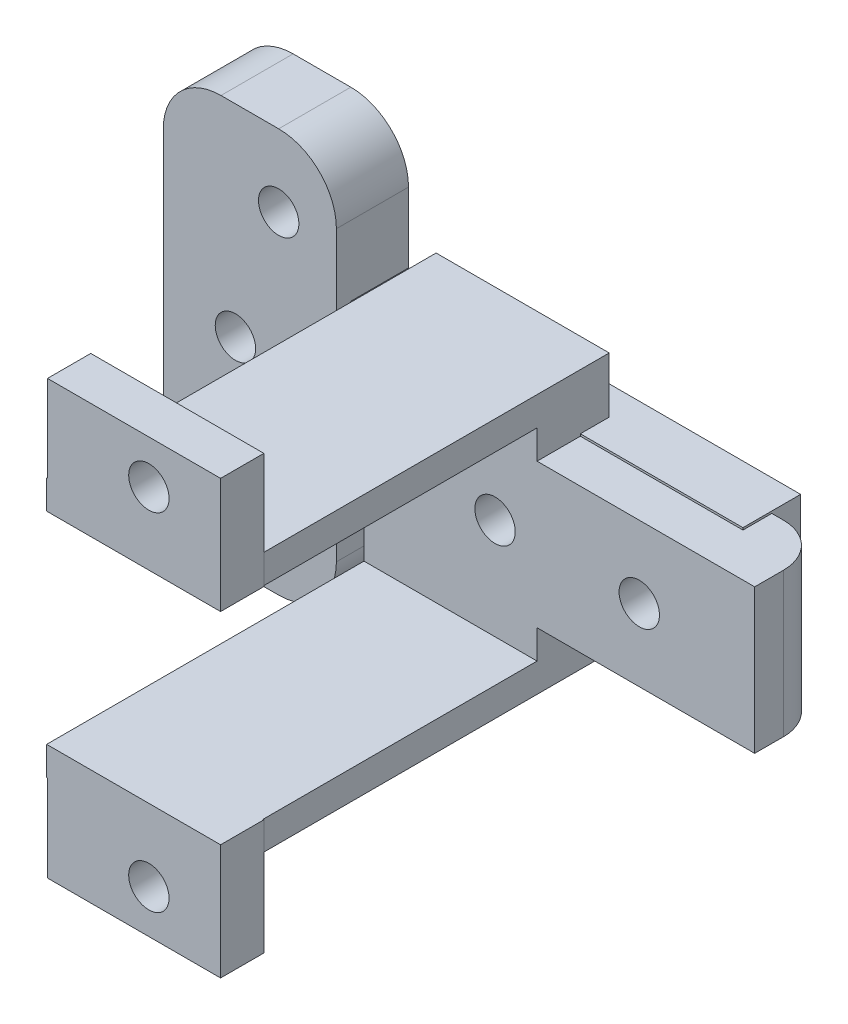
from build123d import *

# Parameters (mm, degrees)
BOSS_EXTRUDE1_DEPTH      = 10
SKETCH5_W                = 12
SKETCH5_H                = 18
BOSS_EXTRUDE3_DEPTH      = 27
SKETCH7_W                = 16
SKETCH7_H                = 14
CUT_EXTRUDE2_DEPTH       = 28
SKETCH8_W                = 12
SKETCH8_H                = 8
BOSS_EXTRUDE4_DEPTH      = 3
SKETCH9_R                = 1.4
CUT_EXTRUDE3_DEPTH       = 3
BOSS_EXTRUDE6_DEPTH      = 1
BOSS_EXTRUDE6_DEPTH_BACK = 4
SKETCH12_W               = 12
SKETCH12_H               = 28
BOSS_EXTRUDE7_DEPTH      = 2
BOSS_EXTRUDE7_DEPTH_BACK = 2
SKETCH13_W               = 27.186584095
SKETCH13_H               = 10.145756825
FILLET3_R                = 3
CUT_EXTRUDE4_DEPTH       = 9
CUT_EXTRUDE4_DEPTH_BACK  = 5
SKETCH10_R               = 1.4
SKETCH14_R               = 1.4
CUT_EXTRUDE5_DEPTH       = 6
FILLET5_R                = 4


with BuildPart() as part:
    # Sketch1 → Boss-Extrude1 (new body)
    with BuildSketch(Plane(origin=(0, 0, 0), x_dir=(1, 0, 0), z_dir=(0, 1, 0))):
        Polygon((18, 1.75), (0, 1.75), (0, 3.75), (43, 3.75), (43, -1.25), (18, -1.25), align=None)
    extrude(amount=BOSS_EXTRUDE1_DEPTH)

    # Sketch5 → Boss-Extrude3 (add)
    with BuildSketch(Plane(origin=(0, 0, -3.75), x_dir=(-1, 0, 0), z_dir=(0, 0, -1))):
        with Locations((-21.913992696, 5)):
            Rectangle(SKETCH5_W, SKETCH5_H)
    extrude(amount=-BOSS_EXTRUDE3_DEPTH)

    # Sketch7 → Cut-Extrude2 (cut)
    with BuildSketch(Plane.XY.offset(1.25)):
        with Locations((20, 5)):
            Rectangle(SKETCH7_W, SKETCH7_H)
    extrude(amount=CUT_EXTRUDE2_DEPTH, mode=Mode.SUBTRACT)

    # Sketch8 → Boss-Extrude4 (add)
    with BuildSketch(Plane.XY.offset(23.25)):
        with Locations((21.972038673, 16)):
            Rectangle(SKETCH8_W, SKETCH8_H)
    boss_extrude4 = extrude(amount=-BOSS_EXTRUDE4_DEPTH)

    # Mirror1: Boss-Extrude4 across plane
    add(boss_extrude4.mirror(Plane.ZX.offset(5)))

    # Sketch9 → Cut-Extrude3 (cut)
    with BuildSketch(Plane(origin=(0, 0, 20.25), x_dir=(-1, 0, 0), z_dir=(0, 0, -1))):
        with Locations((-23, 17)):
            Circle(SKETCH9_R)
    cut_extrude3 = extrude(amount=-CUT_EXTRUDE3_DEPTH, mode=Mode.SUBTRACT)

    # Mirror2: Cut-Extrude3 across plane
    add(cut_extrude3.mirror(Plane.ZX.offset(5)), mode=Mode.SUBTRACT)

    # Sketch12 → Boss-Extrude6 (add, two sides: drawn at the far end of the back side and taken through both)
    with BuildSketch(Plane.XY.offset(-1.75).offset(-BOSS_EXTRUDE6_DEPTH_BACK)):
        with Locations((6, 5)):
            Rectangle(SKETCH12_W, SKETCH12_H)
    extrude(amount=BOSS_EXTRUDE6_DEPTH + BOSS_EXTRUDE6_DEPTH_BACK)

    # Sketch13 → Boss-Extrude7 (add, two sides: drawn at the far end of the back side and taken through both)
    with BuildSketch(Plane(origin=(0, 0, -3.75), x_dir=(-1, 0, 0), z_dir=(0, 0, -1)).offset(-BOSS_EXTRUDE7_DEPTH_BACK)):
        with Locations((-25.593292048, 5.072878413)):
            Rectangle(SKETCH13_W, SKETCH13_H)
    extrude(amount=BOSS_EXTRUDE7_DEPTH + BOSS_EXTRUDE7_DEPTH_BACK)

    # Fillet3
    fillet3_edges = [part.edges().sort_by_distance(p)[0] for p in [
        (43, 5, -3.75),
    ]]
    fillet(fillet3_edges, radius=FILLET3_R)

    # Sketch10 → Cut-Extrude4 (cut, two sides: drawn at the far end of the back side and taken through both)
    with BuildSketch(Plane(origin=(0, 0, -3.75), x_dir=(-1, 0, 0), z_dir=(0, 0, -1)).offset(-CUT_EXTRUDE4_DEPTH_BACK)):
        with Locations((-35, 5)):
            Circle(SKETCH10_R)
        with Locations((-25, 5)):
            Circle(SKETCH10_R)
        with Locations(Location((-15, 5, 0), (0, 0, 229.243028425))):
            Circle(SKETCH10_R)
        with Locations((-5, 5)):
            Circle(SKETCH10_R)
    extrude(amount=CUT_EXTRUDE4_DEPTH + CUT_EXTRUDE4_DEPTH_BACK, mode=Mode.SUBTRACT)

    # Sketch14 → Cut-Extrude5 (cut)
    with BuildSketch(Plane(origin=(0, 0, -5.75), x_dir=(-1, 0, 0), z_dir=(0, 0, -1))):
        with Locations((-8, 14)):
            Circle(SKETCH14_R)
        with Locations((-8, -4)):
            Circle(SKETCH14_R)
    extrude(amount=-CUT_EXTRUDE5_DEPTH, mode=Mode.SUBTRACT)

    # Fillet5
    fillet5_edges = [part.edges().sort_by_distance(p)[0] for p in [
        (0, -9, -3.25),
        (0, 19, -3.25),
        (12, 19, -3.25),
        (12, -9, -3.25),
    ]]
    fillet(fillet5_edges, radius=FILLET5_R)


solid = part.part
